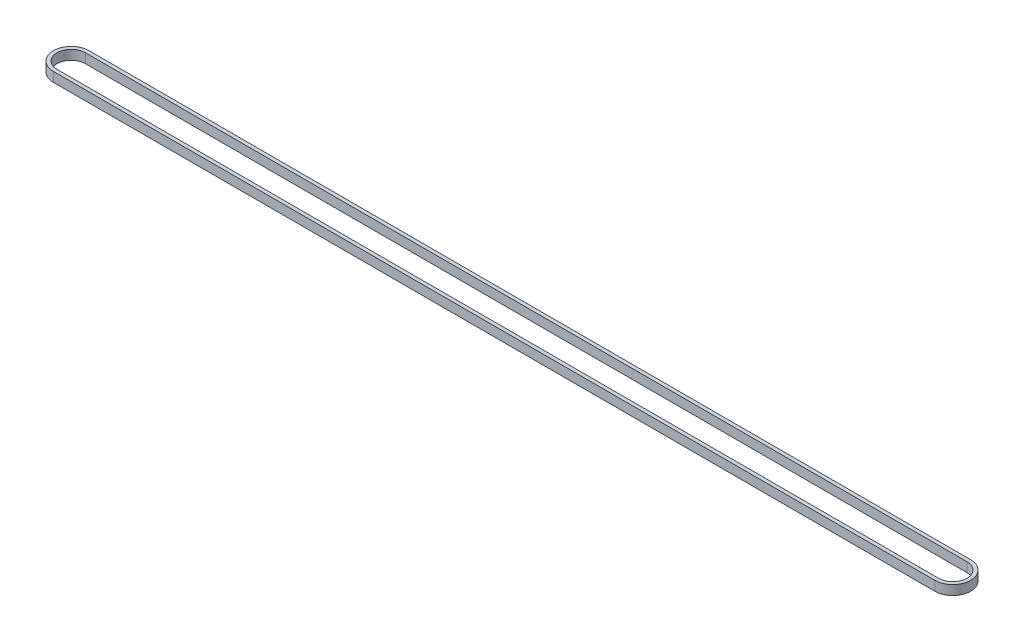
ISO-10303-21;
HEADER;
FILE_DESCRIPTION(('STEP AP214'),'2;1');
FILE_NAME('part.step','',(''),(''),'','','');
FILE_SCHEMA(('AUTOMOTIVE_DESIGN { 1 0 10303 214 1 1 1 1 }'));
ENDSEC;
DATA;
#1=APPLICATION_CONTEXT('core data for automotive mechanical design processes');
#2=APPLICATION_PROTOCOL_DEFINITION('international standard','automotive_design',2000,#1);
#3=PRODUCT_CONTEXT('',#1,'mechanical');
#4=PRODUCT('Part','Part','',(#3));
#5=PRODUCT_RELATED_PRODUCT_CATEGORY('part','',(#4));
#6=PRODUCT_DEFINITION_FORMATION('','',#4);
#7=PRODUCT_DEFINITION_CONTEXT('part definition',#1,'design');
#8=PRODUCT_DEFINITION('design','',#6,#7);
#9=PRODUCT_DEFINITION_SHAPE('','',#8);
#10=(LENGTH_UNIT() NAMED_UNIT(*) SI_UNIT(.MILLI.,.METRE.));
#11=(NAMED_UNIT(*) PLANE_ANGLE_UNIT() SI_UNIT($,.RADIAN.));
#12=(NAMED_UNIT(*) SI_UNIT($,.STERADIAN.) SOLID_ANGLE_UNIT());
#13=UNCERTAINTY_MEASURE_WITH_UNIT(LENGTH_MEASURE(1.E-05),#10,'distance_accuracy_value','');
#14=(GEOMETRIC_REPRESENTATION_CONTEXT(3) GLOBAL_UNCERTAINTY_ASSIGNED_CONTEXT((#13)) GLOBAL_UNIT_ASSIGNED_CONTEXT((#10,
#11,#12)) REPRESENTATION_CONTEXT('',''));
#15=CARTESIAN_POINT('',(0.,0.,0.));
#16=DIRECTION('',(0.,0.,1.));
#17=DIRECTION('',(1.,0.,0.));
#18=AXIS2_PLACEMENT_3D('',#15,#16,#17);
#19=CARTESIAN_POINT('',(0.,4.,0.));
#20=DIRECTION('',(0.,1.,0.));
#21=DIRECTION('',(0.,0.,1.));
#22=AXIS2_PLACEMENT_3D('',#19,#20,#21);
#23=PLANE('',#22);
#24=CARTESIAN_POINT('',(0.,4.,0.));
#25=DIRECTION('',(0.,1.,0.));
#26=DIRECTION('',(0.,0.,1.));
#27=AXIS2_PLACEMENT_3D('',#24,#25,#26);
#28=CIRCLE('',#27,7.5);
#29=CARTESIAN_POINT('',(0.,4.,-7.5));
#30=VERTEX_POINT('',#29);
#31=CARTESIAN_POINT('',(0.,4.,7.5));
#32=VERTEX_POINT('',#31);
#33=EDGE_CURVE('E146',#30,#32,#28,.T.);
#34=ORIENTED_EDGE('',*,*,#33,.T.);
#35=DIRECTION('',(1.,0.,0.));
#36=VECTOR('',#35,1.);
#37=CARTESIAN_POINT('',(0.,4.,7.5));
#38=LINE('',#37,#36);
#39=CARTESIAN_POINT('',(370.,4.,7.5));
#40=VERTEX_POINT('',#39);
#41=EDGE_CURVE('E149',#32,#40,#38,.T.);
#42=ORIENTED_EDGE('',*,*,#41,.T.);
#43=CARTESIAN_POINT('',(370.,4.,0.));
#44=DIRECTION('',(0.,1.,0.));
#45=DIRECTION('',(0.,0.,1.));
#46=AXIS2_PLACEMENT_3D('',#43,#44,#45);
#47=CIRCLE('',#46,7.5);
#48=CARTESIAN_POINT('',(370.,4.,-7.5));
#49=VERTEX_POINT('',#48);
#50=EDGE_CURVE('E152',#40,#49,#47,.T.);
#51=ORIENTED_EDGE('',*,*,#50,.T.);
#52=DIRECTION('',(-1.,0.,0.));
#53=VECTOR('',#52,1.);
#54=CARTESIAN_POINT('',(0.,4.,-7.5));
#55=LINE('',#54,#53);
#56=EDGE_CURVE('E154',#49,#30,#55,.T.);
#57=ORIENTED_EDGE('',*,*,#56,.T.);
#58=EDGE_LOOP('',(#34,#42,#51,#57));
#59=FACE_BOUND('',#58,.T.);
#60=DIRECTION('',(1.,0.,0.));
#61=VECTOR('',#60,1.);
#62=CARTESIAN_POINT('',(0.,4.,6.));
#63=LINE('',#62,#61);
#64=CARTESIAN_POINT('',(0.,4.,6.));
#65=VERTEX_POINT('',#64);
#66=CARTESIAN_POINT('',(370.,4.,6.));
#67=VERTEX_POINT('',#66);
#68=EDGE_CURVE('E118',#65,#67,#63,.T.);
#69=ORIENTED_EDGE('',*,*,#68,.F.);
#70=CARTESIAN_POINT('',(0.,4.,0.));
#71=DIRECTION('',(0.,1.,0.));
#72=DIRECTION('',(0.,0.,1.));
#73=AXIS2_PLACEMENT_3D('',#70,#71,#72);
#74=CIRCLE('',#73,6.);
#75=CARTESIAN_POINT('',(0.,4.,-6.));
#76=VERTEX_POINT('',#75);
#77=EDGE_CURVE('E110',#76,#65,#74,.T.);
#78=ORIENTED_EDGE('',*,*,#77,.F.);
#79=DIRECTION('',(-1.,0.,0.));
#80=VECTOR('',#79,1.);
#81=CARTESIAN_POINT('',(0.,4.,-6.));
#82=LINE('',#81,#80);
#83=CARTESIAN_POINT('',(370.,4.,-6.));
#84=VERTEX_POINT('',#83);
#85=EDGE_CURVE('E132',#84,#76,#82,.T.);
#86=ORIENTED_EDGE('',*,*,#85,.F.);
#87=CARTESIAN_POINT('',(370.,4.,0.));
#88=DIRECTION('',(0.,1.,0.));
#89=DIRECTION('',(0.,0.,1.));
#90=AXIS2_PLACEMENT_3D('',#87,#88,#89);
#91=CIRCLE('',#90,6.);
#92=EDGE_CURVE('E130',#67,#84,#91,.T.);
#93=ORIENTED_EDGE('',*,*,#92,.F.);
#94=EDGE_LOOP('',(#69,#78,#86,#93));
#95=FACE_BOUND('',#94,.T.);
#96=ADVANCED_FACE('F45',(#59,#95),#23,.T.);
#97=CARTESIAN_POINT('',(0.,0.,0.));
#98=DIRECTION('',(0.,1.,0.));
#99=DIRECTION('',(0.,0.,1.));
#100=AXIS2_PLACEMENT_3D('',#97,#98,#99);
#101=PLANE('',#100);
#102=CARTESIAN_POINT('',(0.,0.,0.));
#103=DIRECTION('',(0.,1.,0.));
#104=DIRECTION('',(0.,0.,1.));
#105=AXIS2_PLACEMENT_3D('',#102,#103,#104);
#106=CIRCLE('',#105,7.5);
#107=CARTESIAN_POINT('',(0.,0.,-7.5));
#108=VERTEX_POINT('',#107);
#109=CARTESIAN_POINT('',(0.,0.,7.5));
#110=VERTEX_POINT('',#109);
#111=EDGE_CURVE('E126',#108,#110,#106,.T.);
#112=ORIENTED_EDGE('',*,*,#111,.F.);
#113=DIRECTION('',(-1.,0.,0.));
#114=VECTOR('',#113,1.);
#115=CARTESIAN_POINT('',(0.,0.,-7.5));
#116=LINE('',#115,#114);
#117=CARTESIAN_POINT('',(370.,0.,-7.5));
#118=VERTEX_POINT('',#117);
#119=EDGE_CURVE('E150',#118,#108,#116,.T.);
#120=ORIENTED_EDGE('',*,*,#119,.F.);
#121=CARTESIAN_POINT('',(370.,0.,0.));
#122=DIRECTION('',(0.,1.,0.));
#123=DIRECTION('',(0.,0.,1.));
#124=AXIS2_PLACEMENT_3D('',#121,#122,#123);
#125=CIRCLE('',#124,7.5);
#126=CARTESIAN_POINT('',(370.,0.,7.5));
#127=VERTEX_POINT('',#126);
#128=EDGE_CURVE('E161',#127,#118,#125,.T.);
#129=ORIENTED_EDGE('',*,*,#128,.F.);
#130=DIRECTION('',(1.,0.,0.));
#131=VECTOR('',#130,1.);
#132=CARTESIAN_POINT('',(0.,0.,7.5));
#133=LINE('',#132,#131);
#134=EDGE_CURVE('E159',#110,#127,#133,.T.);
#135=ORIENTED_EDGE('',*,*,#134,.F.);
#136=EDGE_LOOP('',(#112,#120,#129,#135));
#137=FACE_BOUND('',#136,.T.);
#138=CARTESIAN_POINT('',(0.,0.,0.));
#139=DIRECTION('',(0.,1.,0.));
#140=DIRECTION('',(0.,0.,1.));
#141=AXIS2_PLACEMENT_3D('',#138,#139,#140);
#142=CIRCLE('',#141,6.);
#143=CARTESIAN_POINT('',(0.,0.,-6.));
#144=VERTEX_POINT('',#143);
#145=CARTESIAN_POINT('',(0.,0.,6.));
#146=VERTEX_POINT('',#145);
#147=EDGE_CURVE('E68',#144,#146,#142,.T.);
#148=ORIENTED_EDGE('',*,*,#147,.T.);
#149=DIRECTION('',(1.,0.,0.));
#150=VECTOR('',#149,1.);
#151=CARTESIAN_POINT('',(0.,0.,6.));
#152=LINE('',#151,#150);
#153=CARTESIAN_POINT('',(370.,0.,6.));
#154=VERTEX_POINT('',#153);
#155=EDGE_CURVE('E125',#146,#154,#152,.T.);
#156=ORIENTED_EDGE('',*,*,#155,.T.);
#157=CARTESIAN_POINT('',(370.,0.,0.));
#158=DIRECTION('',(0.,1.,0.));
#159=DIRECTION('',(0.,0.,1.));
#160=AXIS2_PLACEMENT_3D('',#157,#158,#159);
#161=CIRCLE('',#160,6.);
#162=CARTESIAN_POINT('',(370.,0.,-6.));
#163=VERTEX_POINT('',#162);
#164=EDGE_CURVE('E138',#154,#163,#161,.T.);
#165=ORIENTED_EDGE('',*,*,#164,.T.);
#166=DIRECTION('',(-1.,0.,0.));
#167=VECTOR('',#166,1.);
#168=CARTESIAN_POINT('',(0.,0.,-6.));
#169=LINE('',#168,#167);
#170=EDGE_CURVE('E119',#163,#144,#169,.T.);
#171=ORIENTED_EDGE('',*,*,#170,.T.);
#172=EDGE_LOOP('',(#148,#156,#165,#171));
#173=FACE_BOUND('',#172,.T.);
#174=ADVANCED_FACE('F179',(#137,#173),#101,.F.);
#175=CARTESIAN_POINT('',(0.,4.,0.));
#176=DIRECTION('',(0.,-1.,0.));
#177=DIRECTION('',(0.,0.,-1.));
#178=AXIS2_PLACEMENT_3D('',#175,#176,#177);
#179=CYLINDRICAL_SURFACE('',#178,7.5);
#180=ORIENTED_EDGE('',*,*,#111,.T.);
#181=DIRECTION('',(0.,-1.,0.));
#182=VECTOR('',#181,1.);
#183=CARTESIAN_POINT('',(0.,4.,7.5));
#184=LINE('',#183,#182);
#185=EDGE_CURVE('E11',#32,#110,#184,.T.);
#186=ORIENTED_EDGE('',*,*,#185,.F.);
#187=ORIENTED_EDGE('',*,*,#33,.F.);
#188=DIRECTION('',(0.,-1.,0.));
#189=VECTOR('',#188,1.);
#190=CARTESIAN_POINT('',(0.,4.,-7.5));
#191=LINE('',#190,#189);
#192=EDGE_CURVE('E156',#30,#108,#191,.T.);
#193=ORIENTED_EDGE('',*,*,#192,.T.);
#194=EDGE_LOOP('',(#180,#186,#187,#193));
#195=FACE_BOUND('',#194,.T.);
#196=ADVANCED_FACE('F47',(#195),#179,.T.);
#197=CARTESIAN_POINT('',(0.,4.,7.5));
#198=DIRECTION('',(0.,0.,-1.));
#199=DIRECTION('',(-1.,0.,0.));
#200=AXIS2_PLACEMENT_3D('',#197,#198,#199);
#201=PLANE('',#200);
#202=ORIENTED_EDGE('',*,*,#134,.T.);
#203=DIRECTION('',(0.,-1.,0.));
#204=VECTOR('',#203,1.);
#205=CARTESIAN_POINT('',(370.,4.,7.5));
#206=LINE('',#205,#204);
#207=EDGE_CURVE('E53',#40,#127,#206,.T.);
#208=ORIENTED_EDGE('',*,*,#207,.F.);
#209=ORIENTED_EDGE('',*,*,#41,.F.);
#210=ORIENTED_EDGE('',*,*,#185,.T.);
#211=EDGE_LOOP('',(#202,#208,#209,#210));
#212=FACE_BOUND('',#211,.T.);
#213=ADVANCED_FACE('F189',(#212),#201,.F.);
#214=CARTESIAN_POINT('',(370.,4.,0.));
#215=DIRECTION('',(0.,-1.,0.));
#216=DIRECTION('',(0.,0.,-1.));
#217=AXIS2_PLACEMENT_3D('',#214,#215,#216);
#218=CYLINDRICAL_SURFACE('',#217,7.5);
#219=ORIENTED_EDGE('',*,*,#128,.T.);
#220=DIRECTION('',(0.,-1.,0.));
#221=VECTOR('',#220,1.);
#222=CARTESIAN_POINT('',(370.,4.,-7.5));
#223=LINE('',#222,#221);
#224=EDGE_CURVE('E166',#49,#118,#223,.T.);
#225=ORIENTED_EDGE('',*,*,#224,.F.);
#226=ORIENTED_EDGE('',*,*,#50,.F.);
#227=ORIENTED_EDGE('',*,*,#207,.T.);
#228=EDGE_LOOP('',(#219,#225,#226,#227));
#229=FACE_BOUND('',#228,.T.);
#230=ADVANCED_FACE('F173',(#229),#218,.T.);
#231=CARTESIAN_POINT('',(0.,4.,-7.5));
#232=DIRECTION('',(0.,0.,1.));
#233=DIRECTION('',(1.,0.,0.));
#234=AXIS2_PLACEMENT_3D('',#231,#232,#233);
#235=PLANE('',#234);
#236=ORIENTED_EDGE('',*,*,#119,.T.);
#237=ORIENTED_EDGE('',*,*,#192,.F.);
#238=ORIENTED_EDGE('',*,*,#56,.F.);
#239=ORIENTED_EDGE('',*,*,#224,.T.);
#240=EDGE_LOOP('',(#236,#237,#238,#239));
#241=FACE_BOUND('',#240,.T.);
#242=ADVANCED_FACE('F183',(#241),#235,.F.);
#243=CARTESIAN_POINT('',(0.,4.,0.));
#244=DIRECTION('',(0.,-1.,0.));
#245=DIRECTION('',(0.,0.,-1.));
#246=AXIS2_PLACEMENT_3D('',#243,#244,#245);
#247=CYLINDRICAL_SURFACE('',#246,6.);
#248=ORIENTED_EDGE('',*,*,#147,.F.);
#249=DIRECTION('',(0.,-1.,0.));
#250=VECTOR('',#249,1.);
#251=CARTESIAN_POINT('',(0.,4.,-6.));
#252=LINE('',#251,#250);
#253=EDGE_CURVE('E114',#76,#144,#252,.T.);
#254=ORIENTED_EDGE('',*,*,#253,.F.);
#255=ORIENTED_EDGE('',*,*,#77,.T.);
#256=DIRECTION('',(0.,-1.,0.));
#257=VECTOR('',#256,1.);
#258=CARTESIAN_POINT('',(0.,4.,6.));
#259=LINE('',#258,#257);
#260=EDGE_CURVE('E113',#65,#146,#259,.T.);
#261=ORIENTED_EDGE('',*,*,#260,.T.);
#262=EDGE_LOOP('',(#248,#254,#255,#261));
#263=FACE_BOUND('',#262,.T.);
#264=ADVANCED_FACE('F112',(#263),#247,.F.);
#265=CARTESIAN_POINT('',(0.,4.,6.));
#266=DIRECTION('',(0.,0.,-1.));
#267=DIRECTION('',(-1.,0.,0.));
#268=AXIS2_PLACEMENT_3D('',#265,#266,#267);
#269=PLANE('',#268);
#270=ORIENTED_EDGE('',*,*,#155,.F.);
#271=ORIENTED_EDGE('',*,*,#260,.F.);
#272=ORIENTED_EDGE('',*,*,#68,.T.);
#273=DIRECTION('',(0.,-1.,0.));
#274=VECTOR('',#273,1.);
#275=CARTESIAN_POINT('',(370.,4.,6.));
#276=LINE('',#275,#274);
#277=EDGE_CURVE('E127',#67,#154,#276,.T.);
#278=ORIENTED_EDGE('',*,*,#277,.T.);
#279=EDGE_LOOP('',(#270,#271,#272,#278));
#280=FACE_BOUND('',#279,.T.);
#281=ADVANCED_FACE('F122',(#280),#269,.T.);
#282=CARTESIAN_POINT('',(370.,4.,0.));
#283=DIRECTION('',(0.,-1.,0.));
#284=DIRECTION('',(0.,0.,-1.));
#285=AXIS2_PLACEMENT_3D('',#282,#283,#284);
#286=CYLINDRICAL_SURFACE('',#285,6.);
#287=ORIENTED_EDGE('',*,*,#164,.F.);
#288=ORIENTED_EDGE('',*,*,#277,.F.);
#289=ORIENTED_EDGE('',*,*,#92,.T.);
#290=DIRECTION('',(0.,-1.,0.));
#291=VECTOR('',#290,1.);
#292=CARTESIAN_POINT('',(370.,4.,-6.));
#293=LINE('',#292,#291);
#294=EDGE_CURVE('E60',#84,#163,#293,.T.);
#295=ORIENTED_EDGE('',*,*,#294,.T.);
#296=EDGE_LOOP('',(#287,#288,#289,#295));
#297=FACE_BOUND('',#296,.T.);
#298=ADVANCED_FACE('F212',(#297),#286,.F.);
#299=CARTESIAN_POINT('',(0.,4.,-6.));
#300=DIRECTION('',(0.,0.,1.));
#301=DIRECTION('',(1.,0.,0.));
#302=AXIS2_PLACEMENT_3D('',#299,#300,#301);
#303=PLANE('',#302);
#304=ORIENTED_EDGE('',*,*,#170,.F.);
#305=ORIENTED_EDGE('',*,*,#294,.F.);
#306=ORIENTED_EDGE('',*,*,#85,.T.);
#307=ORIENTED_EDGE('',*,*,#253,.T.);
#308=EDGE_LOOP('',(#304,#305,#306,#307));
#309=FACE_BOUND('',#308,.T.);
#310=ADVANCED_FACE('F216',(#309),#303,.T.);
#311=CLOSED_SHELL('',(#96,#174,#196,#213,#230,#242,#264,#281,#298,#310));
#312=MANIFOLD_SOLID_BREP('B2',#311);
#313=ADVANCED_BREP_SHAPE_REPRESENTATION('',(#18,#312),#14);
#314=SHAPE_DEFINITION_REPRESENTATION(#9,#313);
ENDSEC;
END-ISO-10303-21;
